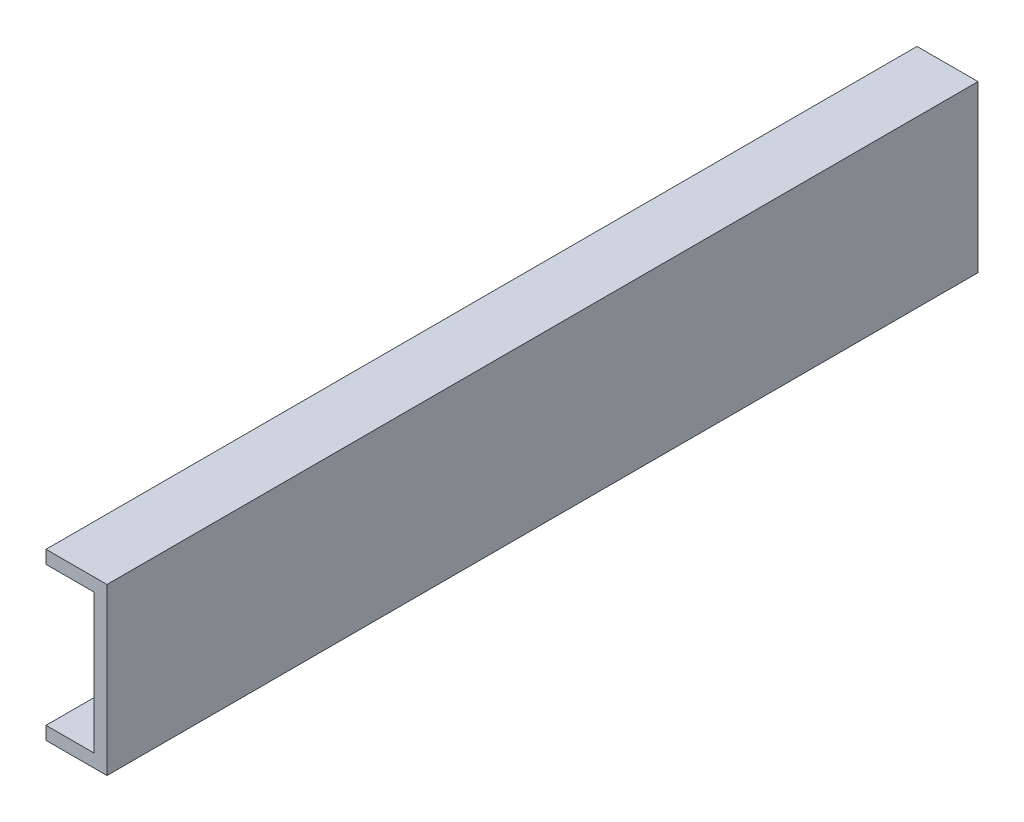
from build123d import *

# Parameters (mm, degrees)
LINEAR_AUSTRAGEN_D_NN1_DEPTH = 200


with BuildPart() as part:
    # Skizze1 → Linear-Austragen-D_nn1 (new body)
    with BuildSketch(Plane.XY):
        Polygon((-14, 19), (0, 19), (0, -19), (-14, -19), (-14, -16), (-3, -16), (-3, 16), (-14, 16), align=None)
    extrude(amount=LINEAR_AUSTRAGEN_D_NN1_DEPTH)


solid = part.part
